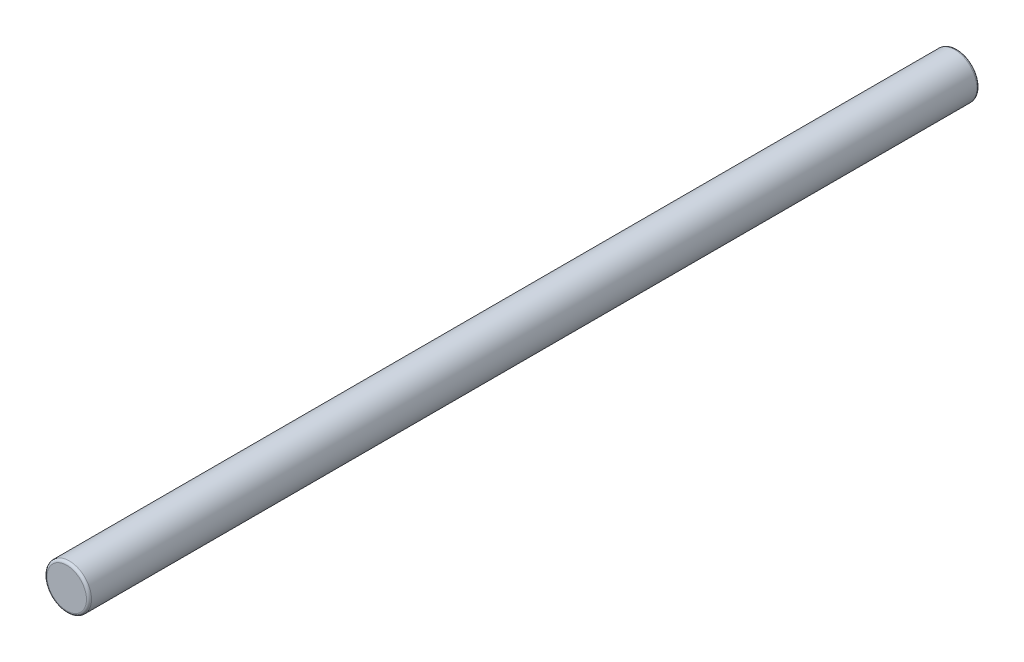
ISO-10303-21;
HEADER;
FILE_DESCRIPTION(('STEP AP214'),'2;1');
FILE_NAME('part.step','',(''),(''),'','','');
FILE_SCHEMA(('AUTOMOTIVE_DESIGN { 1 0 10303 214 1 1 1 1 }'));
ENDSEC;
DATA;
#1=APPLICATION_CONTEXT('core data for automotive mechanical design processes');
#2=APPLICATION_PROTOCOL_DEFINITION('international standard','automotive_design',2000,#1);
#3=PRODUCT_CONTEXT('',#1,'mechanical');
#4=PRODUCT('Part','Part','',(#3));
#5=PRODUCT_RELATED_PRODUCT_CATEGORY('part','',(#4));
#6=PRODUCT_DEFINITION_FORMATION('','',#4);
#7=PRODUCT_DEFINITION_CONTEXT('part definition',#1,'design');
#8=PRODUCT_DEFINITION('design','',#6,#7);
#9=PRODUCT_DEFINITION_SHAPE('','',#8);
#10=(LENGTH_UNIT() NAMED_UNIT(*) SI_UNIT(.MILLI.,.METRE.));
#11=(NAMED_UNIT(*) PLANE_ANGLE_UNIT() SI_UNIT($,.RADIAN.));
#12=(NAMED_UNIT(*) SI_UNIT($,.STERADIAN.) SOLID_ANGLE_UNIT());
#13=UNCERTAINTY_MEASURE_WITH_UNIT(LENGTH_MEASURE(1.E-05),#10,'distance_accuracy_value','');
#14=(GEOMETRIC_REPRESENTATION_CONTEXT(3) GLOBAL_UNCERTAINTY_ASSIGNED_CONTEXT((#13)) GLOBAL_UNIT_ASSIGNED_CONTEXT((#10,
#11,#12)) REPRESENTATION_CONTEXT('',''));
#15=CARTESIAN_POINT('',(0.,0.,0.));
#16=DIRECTION('',(0.,0.,1.));
#17=DIRECTION('',(1.,0.,0.));
#18=AXIS2_PLACEMENT_3D('',#15,#16,#17);
#19=CARTESIAN_POINT('',(0.,0.,0.));
#20=DIRECTION('',(0.,0.,1.));
#21=DIRECTION('',(1.,0.,0.));
#22=AXIS2_PLACEMENT_3D('',#19,#20,#21);
#23=PLANE('',#22);
#24=CARTESIAN_POINT('',(0.,0.,0.));
#25=DIRECTION('',(0.,0.,1.));
#26=DIRECTION('',(1.,0.,0.));
#27=AXIS2_PLACEMENT_3D('',#24,#25,#26);
#28=CIRCLE('',#27,15.5);
#29=CARTESIAN_POINT('',(15.5,0.,0.));
#30=VERTEX_POINT('',#29);
#31=EDGE_CURVE('E48',#30,#30,#28,.T.);
#32=ORIENTED_EDGE('',*,*,#31,.T.);
#33=EDGE_LOOP('',(#32));
#34=FACE_BOUND('',#33,.T.);
#35=ADVANCED_FACE('F33',(#34),#23,.T.);
#36=CARTESIAN_POINT('',(0.,0.,-700.));
#37=DIRECTION('',(0.,0.,1.));
#38=DIRECTION('',(1.,0.,0.));
#39=AXIS2_PLACEMENT_3D('',#36,#37,#38);
#40=PLANE('',#39);
#41=CARTESIAN_POINT('',(0.,0.,-700.));
#42=DIRECTION('',(0.,0.,1.));
#43=DIRECTION('',(1.,0.,0.));
#44=AXIS2_PLACEMENT_3D('',#41,#42,#43);
#45=CIRCLE('',#44,15.5);
#46=CARTESIAN_POINT('',(15.5,0.,-700.));
#47=VERTEX_POINT('',#46);
#48=EDGE_CURVE('E10',#47,#47,#45,.F.);
#49=ORIENTED_EDGE('',*,*,#48,.T.);
#50=EDGE_LOOP('',(#49));
#51=FACE_BOUND('',#50,.T.);
#52=ADVANCED_FACE('F64',(#51),#40,.F.);
#53=CARTESIAN_POINT('',(0.,0.,0.));
#54=DIRECTION('',(0.,0.,-1.));
#55=DIRECTION('',(-1.,0.,0.));
#56=AXIS2_PLACEMENT_3D('',#53,#54,#55);
#57=CYLINDRICAL_SURFACE('',#56,17.5);
#58=CARTESIAN_POINT('',(0.,0.,-2.));
#59=DIRECTION('',(0.,0.,1.));
#60=DIRECTION('',(1.,0.,0.));
#61=AXIS2_PLACEMENT_3D('',#58,#59,#60);
#62=CIRCLE('',#61,17.5);
#63=CARTESIAN_POINT('',(17.5,0.,-2.));
#64=VERTEX_POINT('',#63);
#65=EDGE_CURVE('E40',#64,#64,#62,.F.);
#66=ORIENTED_EDGE('',*,*,#65,.T.);
#67=EDGE_LOOP('',(#66));
#68=FACE_BOUND('',#67,.T.);
#69=CARTESIAN_POINT('',(0.,0.,-698.));
#70=DIRECTION('',(0.,0.,1.));
#71=DIRECTION('',(1.,0.,0.));
#72=AXIS2_PLACEMENT_3D('',#69,#70,#71);
#73=CIRCLE('',#72,17.5);
#74=CARTESIAN_POINT('',(17.5,0.,-698.));
#75=VERTEX_POINT('',#74);
#76=EDGE_CURVE('E44',#75,#75,#73,.T.);
#77=ORIENTED_EDGE('',*,*,#76,.T.);
#78=EDGE_LOOP('',(#77));
#79=FACE_BOUND('',#78,.T.);
#80=ADVANCED_FACE('F57',(#68,#79),#57,.T.);
#81=CARTESIAN_POINT('',(0.,0.,-2.));
#82=DIRECTION('',(0.,0.,1.));
#83=DIRECTION('',(1.,0.,0.));
#84=AXIS2_PLACEMENT_3D('',#81,#82,#83);
#85=TOROIDAL_SURFACE('',#84,15.5,2.);
#86=ORIENTED_EDGE('',*,*,#65,.F.);
#87=EDGE_LOOP('',(#86));
#88=FACE_BOUND('',#87,.T.);
#89=ORIENTED_EDGE('',*,*,#31,.F.);
#90=EDGE_LOOP('',(#89));
#91=FACE_BOUND('',#90,.T.);
#92=ADVANCED_FACE('F55',(#88,#91),#85,.T.);
#93=CARTESIAN_POINT('',(0.,0.,-698.));
#94=DIRECTION('',(0.,0.,1.));
#95=DIRECTION('',(1.,0.,0.));
#96=AXIS2_PLACEMENT_3D('',#93,#94,#95);
#97=TOROIDAL_SURFACE('',#96,15.5,2.);
#98=ORIENTED_EDGE('',*,*,#48,.F.);
#99=EDGE_LOOP('',(#98));
#100=FACE_BOUND('',#99,.T.);
#101=ORIENTED_EDGE('',*,*,#76,.F.);
#102=EDGE_LOOP('',(#101));
#103=FACE_BOUND('',#102,.T.);
#104=ADVANCED_FACE('F35',(#100,#103),#97,.T.);
#105=CLOSED_SHELL('',(#35,#52,#80,#92,#104));
#106=MANIFOLD_SOLID_BREP('B2',#105);
#107=ADVANCED_BREP_SHAPE_REPRESENTATION('',(#18,#106),#14);
#108=SHAPE_DEFINITION_REPRESENTATION(#9,#107);
ENDSEC;
END-ISO-10303-21;
